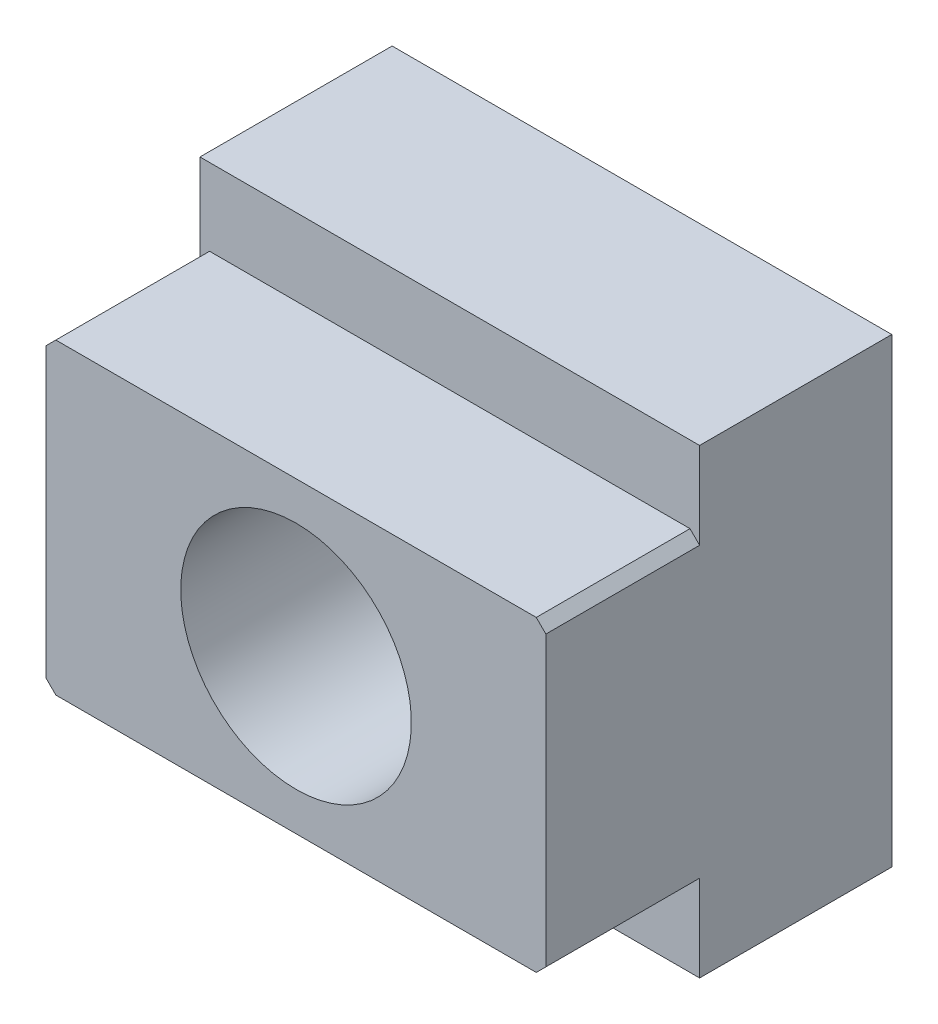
ISO-10303-21;
HEADER;
FILE_DESCRIPTION(('STEP AP214'),'2;1');
FILE_NAME('part.step','',(''),(''),'','','');
FILE_SCHEMA(('AUTOMOTIVE_DESIGN { 1 0 10303 214 1 1 1 1 }'));
ENDSEC;
DATA;
#1=APPLICATION_CONTEXT('core data for automotive mechanical design processes');
#2=APPLICATION_PROTOCOL_DEFINITION('international standard','automotive_design',2000,#1);
#3=PRODUCT_CONTEXT('',#1,'mechanical');
#4=PRODUCT('Part','Part','',(#3));
#5=PRODUCT_RELATED_PRODUCT_CATEGORY('part','',(#4));
#6=PRODUCT_DEFINITION_FORMATION('','',#4);
#7=PRODUCT_DEFINITION_CONTEXT('part definition',#1,'design');
#8=PRODUCT_DEFINITION('design','',#6,#7);
#9=PRODUCT_DEFINITION_SHAPE('','',#8);
#10=(LENGTH_UNIT() NAMED_UNIT(*) SI_UNIT(.MILLI.,.METRE.));
#11=(NAMED_UNIT(*) PLANE_ANGLE_UNIT() SI_UNIT($,.RADIAN.));
#12=(NAMED_UNIT(*) SI_UNIT($,.STERADIAN.) SOLID_ANGLE_UNIT());
#13=UNCERTAINTY_MEASURE_WITH_UNIT(LENGTH_MEASURE(1.E-05),#10,'distance_accuracy_value','');
#14=(GEOMETRIC_REPRESENTATION_CONTEXT(3) GLOBAL_UNCERTAINTY_ASSIGNED_CONTEXT((#13)) GLOBAL_UNIT_ASSIGNED_CONTEXT((#10,
#11,#12)) REPRESENTATION_CONTEXT('',''));
#15=CARTESIAN_POINT('',(0.,0.,0.));
#16=DIRECTION('',(0.,0.,1.));
#17=DIRECTION('',(1.,0.,0.));
#18=AXIS2_PLACEMENT_3D('',#15,#16,#17);
#19=CARTESIAN_POINT('',(-12.75,7.75,-0.766666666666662));
#20=DIRECTION('',(-0.707106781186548,0.707106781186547,0.));
#21=DIRECTION('',(-0.707106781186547,-0.707106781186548,0.));
#22=AXIS2_PLACEMENT_3D('',#19,#20,#21);
#23=PLANE('',#22);
#24=DIRECTION('',(0.707106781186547,0.707106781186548,0.));
#25=VECTOR('',#24,1.);
#26=CARTESIAN_POINT('',(-13.,7.5,0.));
#27=LINE('',#26,#25);
#28=CARTESIAN_POINT('',(-13.,7.5,0.));
#29=VERTEX_POINT('',#28);
#30=CARTESIAN_POINT('',(-12.5,8.,0.));
#31=VERTEX_POINT('',#30);
#32=EDGE_CURVE('E100',#29,#31,#27,.T.);
#33=ORIENTED_EDGE('',*,*,#32,.F.);
#34=DIRECTION('',(0.,0.,1.));
#35=VECTOR('',#34,1.);
#36=CARTESIAN_POINT('',(-13.,7.5,-1.53333333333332));
#37=LINE('',#36,#35);
#38=CARTESIAN_POINT('',(-13.,7.5,8.));
#39=VERTEX_POINT('',#38);
#40=EDGE_CURVE('E129',#29,#39,#37,.T.);
#41=ORIENTED_EDGE('',*,*,#40,.T.);
#42=DIRECTION('',(-0.707106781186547,-0.707106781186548,0.));
#43=VECTOR('',#42,1.);
#44=CARTESIAN_POINT('',(-12.75,7.75,8.));
#45=LINE('',#44,#43);
#46=CARTESIAN_POINT('',(-12.5,8.,8.));
#47=VERTEX_POINT('',#46);
#48=EDGE_CURVE('E17',#39,#47,#45,.F.);
#49=ORIENTED_EDGE('',*,*,#48,.T.);
#50=DIRECTION('',(0.,0.,1.));
#51=VECTOR('',#50,1.);
#52=CARTESIAN_POINT('',(-12.5,8.,0.));
#53=LINE('',#52,#51);
#54=EDGE_CURVE('E127',#31,#47,#53,.T.);
#55=ORIENTED_EDGE('',*,*,#54,.F.);
#56=EDGE_LOOP('',(#33,#41,#49,#55));
#57=FACE_BOUND('',#56,.T.);
#58=ADVANCED_FACE('F14',(#57),#23,.T.);
#59=CARTESIAN_POINT('',(-12.75,-7.75,-0.766666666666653));
#60=DIRECTION('',(-0.707106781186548,-0.707106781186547,0.));
#61=DIRECTION('',(0.707106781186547,-0.707106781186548,0.));
#62=AXIS2_PLACEMENT_3D('',#59,#60,#61);
#63=PLANE('',#62);
#64=DIRECTION('',(0.707106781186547,-0.707106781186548,0.));
#65=VECTOR('',#64,1.);
#66=CARTESIAN_POINT('',(-13.,-7.5,0.));
#67=LINE('',#66,#65);
#68=CARTESIAN_POINT('',(-13.,-7.5,0.));
#69=VERTEX_POINT('',#68);
#70=CARTESIAN_POINT('',(-12.5,-8.,0.));
#71=VERTEX_POINT('',#70);
#72=EDGE_CURVE('E140',#69,#71,#67,.T.);
#73=ORIENTED_EDGE('',*,*,#72,.T.);
#74=DIRECTION('',(0.,0.,1.));
#75=VECTOR('',#74,1.);
#76=CARTESIAN_POINT('',(-12.5,-8.,0.));
#77=LINE('',#76,#75);
#78=CARTESIAN_POINT('',(-12.5,-8.,8.));
#79=VERTEX_POINT('',#78);
#80=EDGE_CURVE('E191',#71,#79,#77,.T.);
#81=ORIENTED_EDGE('',*,*,#80,.T.);
#82=DIRECTION('',(0.707106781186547,-0.707106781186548,0.));
#83=VECTOR('',#82,1.);
#84=CARTESIAN_POINT('',(-12.75,-7.75,8.));
#85=LINE('',#84,#83);
#86=CARTESIAN_POINT('',(-13.,-7.5,8.));
#87=VERTEX_POINT('',#86);
#88=EDGE_CURVE('E144',#79,#87,#85,.F.);
#89=ORIENTED_EDGE('',*,*,#88,.T.);
#90=DIRECTION('',(0.,0.,1.));
#91=VECTOR('',#90,1.);
#92=CARTESIAN_POINT('',(-13.,-7.5,-1.53333333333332));
#93=LINE('',#92,#91);
#94=EDGE_CURVE('E207',#87,#69,#93,.F.);
#95=ORIENTED_EDGE('',*,*,#94,.T.);
#96=EDGE_LOOP('',(#73,#81,#89,#95));
#97=FACE_BOUND('',#96,.T.);
#98=ADVANCED_FACE('F234',(#97),#63,.T.);
#99=CARTESIAN_POINT('',(-13.,12.,0.));
#100=DIRECTION('',(0.,0.,1.));
#101=DIRECTION('',(0.,-1.,0.));
#102=AXIS2_PLACEMENT_3D('',#99,#100,#101);
#103=PLANE('',#102);
#104=DIRECTION('',(0.,-1.,0.));
#105=VECTOR('',#104,1.);
#106=CARTESIAN_POINT('',(13.,5.46666666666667,0.));
#107=LINE('',#106,#105);
#108=CARTESIAN_POINT('',(13.,12.,0.));
#109=VERTEX_POINT('',#108);
#110=CARTESIAN_POINT('',(13.,7.5,0.));
#111=VERTEX_POINT('',#110);
#112=EDGE_CURVE('E186',#109,#111,#107,.T.);
#113=ORIENTED_EDGE('',*,*,#112,.F.);
#114=DIRECTION('',(1.,0.,0.));
#115=VECTOR('',#114,1.);
#116=CARTESIAN_POINT('',(-13.,12.,0.));
#117=LINE('',#116,#115);
#118=CARTESIAN_POINT('',(-13.,12.,0.));
#119=VERTEX_POINT('',#118);
#120=EDGE_CURVE('E124',#119,#109,#117,.T.);
#121=ORIENTED_EDGE('',*,*,#120,.F.);
#122=DIRECTION('',(0.,-1.,0.));
#123=VECTOR('',#122,1.);
#124=CARTESIAN_POINT('',(-13.,5.46666666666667,0.));
#125=LINE('',#124,#123);
#126=EDGE_CURVE('E196',#119,#29,#125,.T.);
#127=ORIENTED_EDGE('',*,*,#126,.T.);
#128=ORIENTED_EDGE('',*,*,#32,.T.);
#129=DIRECTION('',(1.,0.,0.));
#130=VECTOR('',#129,1.);
#131=CARTESIAN_POINT('',(-13.,8.,0.));
#132=LINE('',#131,#130);
#133=CARTESIAN_POINT('',(12.5,8.,0.));
#134=VERTEX_POINT('',#133);
#135=EDGE_CURVE('E120',#134,#31,#132,.F.);
#136=ORIENTED_EDGE('',*,*,#135,.F.);
#137=DIRECTION('',(-0.707106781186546,0.707106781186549,0.));
#138=VECTOR('',#137,1.);
#139=CARTESIAN_POINT('',(12.75,7.75,0.));
#140=LINE('',#139,#138);
#141=EDGE_CURVE('E107',#111,#134,#140,.T.);
#142=ORIENTED_EDGE('',*,*,#141,.F.);
#143=EDGE_LOOP('',(#113,#121,#127,#128,#136,#142));
#144=FACE_BOUND('',#143,.T.);
#145=ADVANCED_FACE('F126',(#144),#103,.T.);
#146=CARTESIAN_POINT('',(12.75,7.75,-0.766666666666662));
#147=DIRECTION('',(0.707106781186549,0.707106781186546,0.));
#148=DIRECTION('',(-0.707106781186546,0.707106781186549,0.));
#149=AXIS2_PLACEMENT_3D('',#146,#147,#148);
#150=PLANE('',#149);
#151=ORIENTED_EDGE('',*,*,#141,.T.);
#152=DIRECTION('',(0.,0.,1.));
#153=VECTOR('',#152,1.);
#154=CARTESIAN_POINT('',(12.5,8.,0.));
#155=LINE('',#154,#153);
#156=CARTESIAN_POINT('',(12.5,8.,8.));
#157=VERTEX_POINT('',#156);
#158=EDGE_CURVE('E110',#157,#134,#155,.F.);
#159=ORIENTED_EDGE('',*,*,#158,.F.);
#160=DIRECTION('',(-0.707106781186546,0.707106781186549,0.));
#161=VECTOR('',#160,1.);
#162=CARTESIAN_POINT('',(12.75,7.75,8.));
#163=LINE('',#162,#161);
#164=CARTESIAN_POINT('',(13.,7.5,8.));
#165=VERTEX_POINT('',#164);
#166=EDGE_CURVE('E115',#157,#165,#163,.F.);
#167=ORIENTED_EDGE('',*,*,#166,.T.);
#168=DIRECTION('',(0.,0.,1.));
#169=VECTOR('',#168,1.);
#170=CARTESIAN_POINT('',(13.,7.5,-1.53333333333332));
#171=LINE('',#170,#169);
#172=EDGE_CURVE('E113',#111,#165,#171,.T.);
#173=ORIENTED_EDGE('',*,*,#172,.F.);
#174=EDGE_LOOP('',(#151,#159,#167,#173));
#175=FACE_BOUND('',#174,.T.);
#176=ADVANCED_FACE('F109',(#175),#150,.T.);
#177=CARTESIAN_POINT('',(12.75,-7.75,-0.766666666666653));
#178=DIRECTION('',(0.707106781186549,-0.707106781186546,0.));
#179=DIRECTION('',(0.707106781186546,0.707106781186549,0.));
#180=AXIS2_PLACEMENT_3D('',#177,#178,#179);
#181=PLANE('',#180);
#182=DIRECTION('',(0.707106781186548,0.707106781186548,0.));
#183=VECTOR('',#182,1.);
#184=CARTESIAN_POINT('',(12.5,-8.,0.));
#185=LINE('',#184,#183);
#186=CARTESIAN_POINT('',(12.5,-8.,0.));
#187=VERTEX_POINT('',#186);
#188=CARTESIAN_POINT('',(13.,-7.5,0.));
#189=VERTEX_POINT('',#188);
#190=EDGE_CURVE('E137',#187,#189,#185,.T.);
#191=ORIENTED_EDGE('',*,*,#190,.T.);
#192=DIRECTION('',(0.,0.,1.));
#193=VECTOR('',#192,1.);
#194=CARTESIAN_POINT('',(13.,-7.5,-1.53333333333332));
#195=LINE('',#194,#193);
#196=CARTESIAN_POINT('',(13.,-7.5,8.));
#197=VERTEX_POINT('',#196);
#198=EDGE_CURVE('E183',#197,#189,#195,.F.);
#199=ORIENTED_EDGE('',*,*,#198,.F.);
#200=DIRECTION('',(0.707106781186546,0.707106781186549,0.));
#201=VECTOR('',#200,1.);
#202=CARTESIAN_POINT('',(12.75,-7.75,8.));
#203=LINE('',#202,#201);
#204=CARTESIAN_POINT('',(12.5,-8.,8.));
#205=VERTEX_POINT('',#204);
#206=EDGE_CURVE('E31',#197,#205,#203,.F.);
#207=ORIENTED_EDGE('',*,*,#206,.T.);
#208=DIRECTION('',(0.,0.,1.));
#209=VECTOR('',#208,1.);
#210=CARTESIAN_POINT('',(12.5,-8.,0.));
#211=LINE('',#210,#209);
#212=EDGE_CURVE('E188',#205,#187,#211,.F.);
#213=ORIENTED_EDGE('',*,*,#212,.T.);
#214=EDGE_LOOP('',(#191,#199,#207,#213));
#215=FACE_BOUND('',#214,.T.);
#216=ADVANCED_FACE('F240',(#215),#181,.T.);
#217=CARTESIAN_POINT('',(-13.,-12.,0.));
#218=DIRECTION('',(0.,0.,-1.));
#219=DIRECTION('',(0.,1.,0.));
#220=AXIS2_PLACEMENT_3D('',#217,#218,#219);
#221=PLANE('',#220);
#222=DIRECTION('',(1.,0.,0.));
#223=VECTOR('',#222,1.);
#224=CARTESIAN_POINT('',(-13.,-12.,0.));
#225=LINE('',#224,#223);
#226=CARTESIAN_POINT('',(-13.,-12.,0.));
#227=VERTEX_POINT('',#226);
#228=CARTESIAN_POINT('',(13.,-12.,0.));
#229=VERTEX_POINT('',#228);
#230=EDGE_CURVE('E134',#227,#229,#225,.T.);
#231=ORIENTED_EDGE('',*,*,#230,.T.);
#232=DIRECTION('',(0.,-1.,0.));
#233=VECTOR('',#232,1.);
#234=CARTESIAN_POINT('',(13.,5.46666666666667,0.));
#235=LINE('',#234,#233);
#236=EDGE_CURVE('E181',#189,#229,#235,.T.);
#237=ORIENTED_EDGE('',*,*,#236,.F.);
#238=ORIENTED_EDGE('',*,*,#190,.F.);
#239=DIRECTION('',(1.,0.,0.));
#240=VECTOR('',#239,1.);
#241=CARTESIAN_POINT('',(-13.,-8.,0.));
#242=LINE('',#241,#240);
#243=EDGE_CURVE('E193',#187,#71,#242,.F.);
#244=ORIENTED_EDGE('',*,*,#243,.T.);
#245=ORIENTED_EDGE('',*,*,#72,.F.);
#246=DIRECTION('',(0.,-1.,0.));
#247=VECTOR('',#246,1.);
#248=CARTESIAN_POINT('',(-13.,5.46666666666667,0.));
#249=LINE('',#248,#247);
#250=EDGE_CURVE('E204',#69,#227,#249,.T.);
#251=ORIENTED_EDGE('',*,*,#250,.T.);
#252=EDGE_LOOP('',(#231,#237,#238,#244,#245,#251));
#253=FACE_BOUND('',#252,.T.);
#254=ADVANCED_FACE('F231',(#253),#221,.F.);
#255=CARTESIAN_POINT('',(-13.,-12.,-10.));
#256=DIRECTION('',(0.,1.,0.));
#257=DIRECTION('',(0.,0.,1.));
#258=AXIS2_PLACEMENT_3D('',#255,#256,#257);
#259=PLANE('',#258);
#260=DIRECTION('',(1.,0.,0.));
#261=VECTOR('',#260,1.);
#262=CARTESIAN_POINT('',(-13.,-12.,-10.));
#263=LINE('',#262,#261);
#264=CARTESIAN_POINT('',(13.,-12.,-10.));
#265=VERTEX_POINT('',#264);
#266=CARTESIAN_POINT('',(-13.,-12.,-10.));
#267=VERTEX_POINT('',#266);
#268=EDGE_CURVE('E171',#265,#267,#263,.F.);
#269=ORIENTED_EDGE('',*,*,#268,.F.);
#270=DIRECTION('',(0.,0.,1.));
#271=VECTOR('',#270,1.);
#272=CARTESIAN_POINT('',(13.,-12.,-1.53333333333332));
#273=LINE('',#272,#271);
#274=EDGE_CURVE('E179',#229,#265,#273,.F.);
#275=ORIENTED_EDGE('',*,*,#274,.F.);
#276=ORIENTED_EDGE('',*,*,#230,.F.);
#277=DIRECTION('',(0.,0.,1.));
#278=VECTOR('',#277,1.);
#279=CARTESIAN_POINT('',(-13.,-12.,-1.53333333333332));
#280=LINE('',#279,#278);
#281=EDGE_CURVE('E201',#227,#267,#280,.F.);
#282=ORIENTED_EDGE('',*,*,#281,.T.);
#283=EDGE_LOOP('',(#269,#275,#276,#282));
#284=FACE_BOUND('',#283,.T.);
#285=ADVANCED_FACE('F228',(#284),#259,.F.);
#286=CARTESIAN_POINT('',(-13.,12.,-10.));
#287=DIRECTION('',(0.,1.,0.));
#288=DIRECTION('',(0.,0.,1.));
#289=AXIS2_PLACEMENT_3D('',#286,#287,#288);
#290=PLANE('',#289);
#291=DIRECTION('',(0.,0.,1.));
#292=VECTOR('',#291,1.);
#293=CARTESIAN_POINT('',(13.,12.,-1.53333333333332));
#294=LINE('',#293,#292);
#295=CARTESIAN_POINT('',(13.,12.,-10.));
#296=VERTEX_POINT('',#295);
#297=EDGE_CURVE('E176',#296,#109,#294,.T.);
#298=ORIENTED_EDGE('',*,*,#297,.F.);
#299=DIRECTION('',(1.,0.,0.));
#300=VECTOR('',#299,1.);
#301=CARTESIAN_POINT('',(-13.,12.,-10.));
#302=LINE('',#301,#300);
#303=CARTESIAN_POINT('',(-13.,12.,-10.));
#304=VERTEX_POINT('',#303);
#305=EDGE_CURVE('E165',#304,#296,#302,.T.);
#306=ORIENTED_EDGE('',*,*,#305,.F.);
#307=DIRECTION('',(0.,0.,1.));
#308=VECTOR('',#307,1.);
#309=CARTESIAN_POINT('',(-13.,12.,-1.53333333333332));
#310=LINE('',#309,#308);
#311=EDGE_CURVE('E198',#304,#119,#310,.T.);
#312=ORIENTED_EDGE('',*,*,#311,.T.);
#313=ORIENTED_EDGE('',*,*,#120,.T.);
#314=EDGE_LOOP('',(#298,#306,#312,#313));
#315=FACE_BOUND('',#314,.T.);
#316=ADVANCED_FACE('F221',(#315),#290,.T.);
#317=CARTESIAN_POINT('',(-13.,8.,0.));
#318=DIRECTION('',(0.,1.,0.));
#319=DIRECTION('',(0.,0.,1.));
#320=AXIS2_PLACEMENT_3D('',#317,#318,#319);
#321=PLANE('',#320);
#322=ORIENTED_EDGE('',*,*,#54,.T.);
#323=DIRECTION('',(1.,0.,0.));
#324=VECTOR('',#323,1.);
#325=CARTESIAN_POINT('',(-13.,8.,8.));
#326=LINE('',#325,#324);
#327=EDGE_CURVE('E123',#157,#47,#326,.F.);
#328=ORIENTED_EDGE('',*,*,#327,.F.);
#329=ORIENTED_EDGE('',*,*,#158,.T.);
#330=ORIENTED_EDGE('',*,*,#135,.T.);
#331=EDGE_LOOP('',(#322,#328,#329,#330));
#332=FACE_BOUND('',#331,.T.);
#333=ADVANCED_FACE('F119',(#332),#321,.T.);
#334=CARTESIAN_POINT('',(-13.,5.46666666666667,-1.53333333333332));
#335=DIRECTION('',(1.,0.,0.));
#336=DIRECTION('',(0.,0.,1.));
#337=AXIS2_PLACEMENT_3D('',#334,#335,#336);
#338=PLANE('',#337);
#339=ORIENTED_EDGE('',*,*,#311,.F.);
#340=DIRECTION('',(0.,1.,0.));
#341=VECTOR('',#340,1.);
#342=CARTESIAN_POINT('',(-13.,0.,-10.));
#343=LINE('',#342,#341);
#344=EDGE_CURVE('E168',#267,#304,#343,.T.);
#345=ORIENTED_EDGE('',*,*,#344,.F.);
#346=ORIENTED_EDGE('',*,*,#281,.F.);
#347=ORIENTED_EDGE('',*,*,#250,.F.);
#348=ORIENTED_EDGE('',*,*,#94,.F.);
#349=DIRECTION('',(0.,-1.,0.));
#350=VECTOR('',#349,1.);
#351=CARTESIAN_POINT('',(-13.,8.,8.));
#352=LINE('',#351,#350);
#353=EDGE_CURVE('E161',#39,#87,#352,.T.);
#354=ORIENTED_EDGE('',*,*,#353,.F.);
#355=ORIENTED_EDGE('',*,*,#40,.F.);
#356=ORIENTED_EDGE('',*,*,#126,.F.);
#357=EDGE_LOOP('',(#339,#345,#346,#347,#348,#354,#355,#356));
#358=FACE_BOUND('',#357,.T.);
#359=ADVANCED_FACE('F211',(#358),#338,.F.);
#360=CARTESIAN_POINT('',(-13.,-8.,0.));
#361=DIRECTION('',(0.,1.,0.));
#362=DIRECTION('',(0.,0.,1.));
#363=AXIS2_PLACEMENT_3D('',#360,#361,#362);
#364=PLANE('',#363);
#365=DIRECTION('',(1.,0.,0.));
#366=VECTOR('',#365,1.);
#367=CARTESIAN_POINT('',(-13.,-8.,8.));
#368=LINE('',#367,#366);
#369=EDGE_CURVE('E23',#79,#205,#368,.T.);
#370=ORIENTED_EDGE('',*,*,#369,.F.);
#371=ORIENTED_EDGE('',*,*,#80,.F.);
#372=ORIENTED_EDGE('',*,*,#243,.F.);
#373=ORIENTED_EDGE('',*,*,#212,.F.);
#374=EDGE_LOOP('',(#370,#371,#372,#373));
#375=FACE_BOUND('',#374,.T.);
#376=ADVANCED_FACE('F237',(#375),#364,.F.);
#377=CARTESIAN_POINT('',(13.,5.46666666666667,-1.53333333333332));
#378=DIRECTION('',(1.,0.,0.));
#379=DIRECTION('',(0.,0.,1.));
#380=AXIS2_PLACEMENT_3D('',#377,#378,#379);
#381=PLANE('',#380);
#382=DIRECTION('',(0.,1.,0.));
#383=VECTOR('',#382,1.);
#384=CARTESIAN_POINT('',(13.,0.,-10.));
#385=LINE('',#384,#383);
#386=EDGE_CURVE('E173',#296,#265,#385,.F.);
#387=ORIENTED_EDGE('',*,*,#386,.F.);
#388=ORIENTED_EDGE('',*,*,#297,.T.);
#389=ORIENTED_EDGE('',*,*,#112,.T.);
#390=ORIENTED_EDGE('',*,*,#172,.T.);
#391=DIRECTION('',(0.,-1.,0.));
#392=VECTOR('',#391,1.);
#393=CARTESIAN_POINT('',(13.,8.,8.));
#394=LINE('',#393,#392);
#395=EDGE_CURVE('E9',#197,#165,#394,.F.);
#396=ORIENTED_EDGE('',*,*,#395,.F.);
#397=ORIENTED_EDGE('',*,*,#198,.T.);
#398=ORIENTED_EDGE('',*,*,#236,.T.);
#399=ORIENTED_EDGE('',*,*,#274,.T.);
#400=EDGE_LOOP('',(#387,#388,#389,#390,#396,#397,#398,#399));
#401=FACE_BOUND('',#400,.T.);
#402=ADVANCED_FACE('F217',(#401),#381,.T.);
#403=CARTESIAN_POINT('',(-13.,0.,-10.));
#404=DIRECTION('',(0.,0.,-1.));
#405=DIRECTION('',(0.,1.,0.));
#406=AXIS2_PLACEMENT_3D('',#403,#404,#405);
#407=PLANE('',#406);
#408=CARTESIAN_POINT('',(0.,0.,-10.));
#409=DIRECTION('',(0.,0.,1.));
#410=DIRECTION('',(0.,-1.,0.));
#411=AXIS2_PLACEMENT_3D('',#408,#409,#410);
#412=CIRCLE('',#411,6.);
#413=CARTESIAN_POINT('',(0.,-6.,-10.));
#414=VERTEX_POINT('',#413);
#415=EDGE_CURVE('E149',#414,#414,#412,.T.);
#416=ORIENTED_EDGE('',*,*,#415,.T.);
#417=EDGE_LOOP('',(#416));
#418=FACE_BOUND('',#417,.T.);
#419=ORIENTED_EDGE('',*,*,#344,.T.);
#420=ORIENTED_EDGE('',*,*,#305,.T.);
#421=ORIENTED_EDGE('',*,*,#386,.T.);
#422=ORIENTED_EDGE('',*,*,#268,.T.);
#423=EDGE_LOOP('',(#419,#420,#421,#422));
#424=FACE_BOUND('',#423,.T.);
#425=ADVANCED_FACE('F223',(#418,#424),#407,.T.);
#426=CARTESIAN_POINT('',(-13.,8.,8.));
#427=DIRECTION('',(0.,0.,1.));
#428=DIRECTION('',(0.,-1.,0.));
#429=AXIS2_PLACEMENT_3D('',#426,#427,#428);
#430=PLANE('',#429);
#431=CARTESIAN_POINT('',(0.,0.,8.));
#432=DIRECTION('',(0.,0.,1.));
#433=DIRECTION('',(0.,-1.,0.));
#434=AXIS2_PLACEMENT_3D('',#431,#432,#433);
#435=CIRCLE('',#434,6.);
#436=CARTESIAN_POINT('',(0.,-6.,8.));
#437=VERTEX_POINT('',#436);
#438=EDGE_CURVE('E153',#437,#437,#435,.T.);
#439=ORIENTED_EDGE('',*,*,#438,.F.);
#440=EDGE_LOOP('',(#439));
#441=FACE_BOUND('',#440,.T.);
#442=ORIENTED_EDGE('',*,*,#206,.F.);
#443=ORIENTED_EDGE('',*,*,#395,.T.);
#444=ORIENTED_EDGE('',*,*,#166,.F.);
#445=ORIENTED_EDGE('',*,*,#327,.T.);
#446=ORIENTED_EDGE('',*,*,#48,.F.);
#447=ORIENTED_EDGE('',*,*,#353,.T.);
#448=ORIENTED_EDGE('',*,*,#88,.F.);
#449=ORIENTED_EDGE('',*,*,#369,.T.);
#450=EDGE_LOOP('',(#442,#443,#444,#445,#446,#447,#448,#449));
#451=FACE_BOUND('',#450,.T.);
#452=ADVANCED_FACE('F213',(#441,#451),#430,.T.);
#453=CARTESIAN_POINT('',(0.,0.,-10.));
#454=DIRECTION('',(0.,0.,1.));
#455=DIRECTION('',(0.,-1.,0.));
#456=AXIS2_PLACEMENT_3D('',#453,#454,#455);
#457=CYLINDRICAL_SURFACE('',#456,6.);
#458=ORIENTED_EDGE('',*,*,#415,.F.);
#459=EDGE_LOOP('',(#458));
#460=FACE_BOUND('',#459,.T.);
#461=ORIENTED_EDGE('',*,*,#438,.T.);
#462=EDGE_LOOP('',(#461));
#463=FACE_BOUND('',#462,.T.);
#464=ADVANCED_FACE('F251',(#460,#463),#457,.F.);
#465=CLOSED_SHELL('',(#58,#98,#145,#176,#216,#254,#285,#316,#333,#359,#376,#402,#425,#452,#464));
#466=MANIFOLD_SOLID_BREP('B1',#465);
#467=ADVANCED_BREP_SHAPE_REPRESENTATION('',(#18,#466),#14);
#468=SHAPE_DEFINITION_REPRESENTATION(#9,#467);
ENDSEC;
END-ISO-10303-21;
